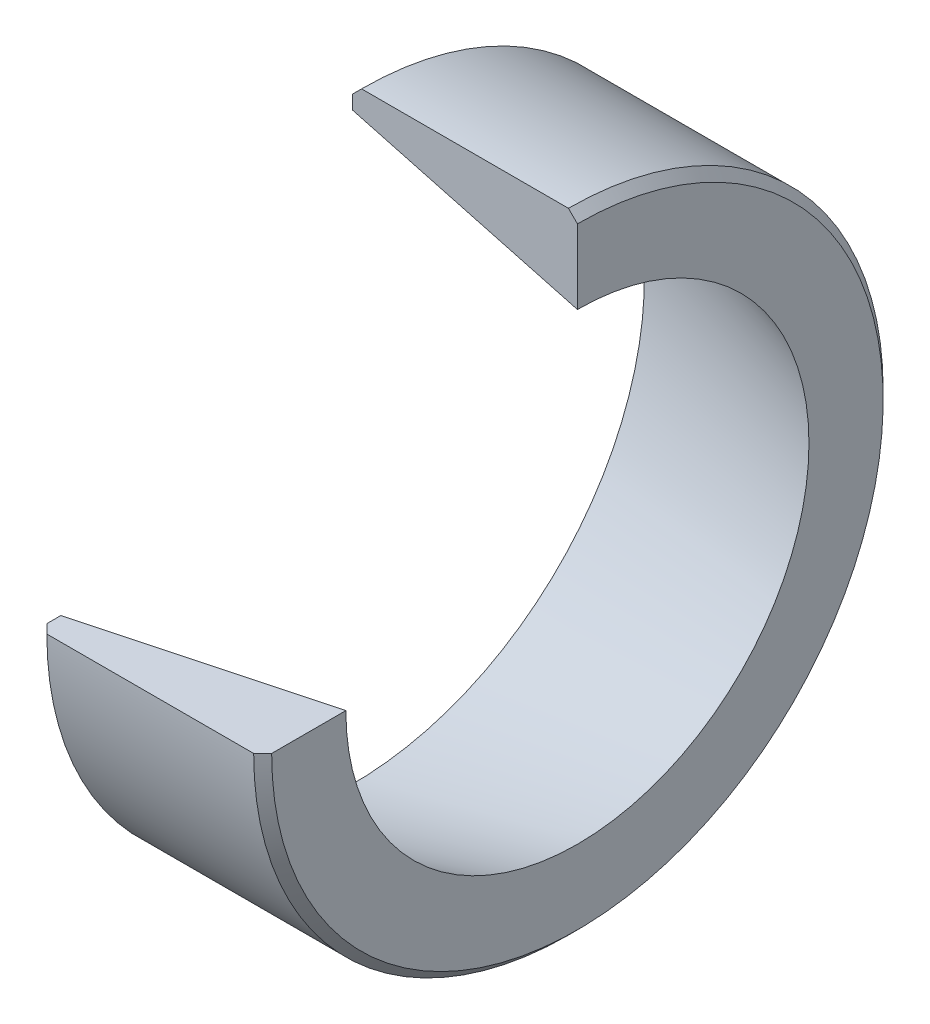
ISO-10303-21;
HEADER;
FILE_DESCRIPTION(('STEP AP214'),'2;1');
FILE_NAME('part.step','',(''),(''),'','','');
FILE_SCHEMA(('AUTOMOTIVE_DESIGN { 1 0 10303 214 1 1 1 1 }'));
ENDSEC;
DATA;
#1=APPLICATION_CONTEXT('core data for automotive mechanical design processes');
#2=APPLICATION_PROTOCOL_DEFINITION('international standard','automotive_design',2000,#1);
#3=PRODUCT_CONTEXT('',#1,'mechanical');
#4=PRODUCT('Part','Part','',(#3));
#5=PRODUCT_RELATED_PRODUCT_CATEGORY('part','',(#4));
#6=PRODUCT_DEFINITION_FORMATION('','',#4);
#7=PRODUCT_DEFINITION_CONTEXT('part definition',#1,'design');
#8=PRODUCT_DEFINITION('design','',#6,#7);
#9=PRODUCT_DEFINITION_SHAPE('','',#8);
#10=(LENGTH_UNIT() NAMED_UNIT(*) SI_UNIT(.MILLI.,.METRE.));
#11=(NAMED_UNIT(*) PLANE_ANGLE_UNIT() SI_UNIT($,.RADIAN.));
#12=(NAMED_UNIT(*) SI_UNIT($,.STERADIAN.) SOLID_ANGLE_UNIT());
#13=UNCERTAINTY_MEASURE_WITH_UNIT(LENGTH_MEASURE(1.E-05),#10,'distance_accuracy_value','');
#14=(GEOMETRIC_REPRESENTATION_CONTEXT(3) GLOBAL_UNCERTAINTY_ASSIGNED_CONTEXT((#13)) GLOBAL_UNIT_ASSIGNED_CONTEXT((#10,
#11,#12)) REPRESENTATION_CONTEXT('',''));
#15=CARTESIAN_POINT('',(0.,0.,0.));
#16=DIRECTION('',(0.,0.,1.));
#17=DIRECTION('',(1.,0.,0.));
#18=AXIS2_PLACEMENT_3D('',#15,#16,#17);
#19=CARTESIAN_POINT('',(-7.04369747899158,0.,0.));
#20=DIRECTION('',(-1.,0.,0.));
#21=DIRECTION('',(0.,0.,1.));
#22=AXIS2_PLACEMENT_3D('',#19,#20,#21);
#23=CYLINDRICAL_SURFACE('',#22,7.);
#24=DIRECTION('',(1.,0.,0.));
#25=VECTOR('',#24,1.);
#26=CARTESIAN_POINT('',(-0.00100000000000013,0.,7.));
#27=LINE('',#26,#25);
#28=CARTESIAN_POINT('',(0.2,0.,7.));
#29=VERTEX_POINT('',#28);
#30=CARTESIAN_POINT('',(4.8,0.,7.));
#31=VERTEX_POINT('',#30);
#32=EDGE_CURVE('E112',#29,#31,#27,.T.);
#33=ORIENTED_EDGE('',*,*,#32,.F.);
#34=CARTESIAN_POINT('',(0.2,0.,0.));
#35=DIRECTION('',(1.,0.,0.));
#36=DIRECTION('',(0.,0.,-1.));
#37=AXIS2_PLACEMENT_3D('',#34,#35,#36);
#38=CIRCLE('',#37,7.);
#39=CARTESIAN_POINT('',(0.199999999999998,7.,0.));
#40=VERTEX_POINT('',#39);
#41=EDGE_CURVE('E124',#29,#40,#38,.T.);
#42=ORIENTED_EDGE('',*,*,#41,.T.);
#43=DIRECTION('',(1.,0.,0.));
#44=VECTOR('',#43,1.);
#45=CARTESIAN_POINT('',(-0.00100000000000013,7.,0.));
#46=LINE('',#45,#44);
#47=CARTESIAN_POINT('',(4.8,7.,0.));
#48=VERTEX_POINT('',#47);
#49=EDGE_CURVE('E129',#40,#48,#46,.T.);
#50=ORIENTED_EDGE('',*,*,#49,.T.);
#51=CARTESIAN_POINT('',(4.8,0.,0.));
#52=DIRECTION('',(-1.,0.,0.));
#53=DIRECTION('',(0.,0.,1.));
#54=AXIS2_PLACEMENT_3D('',#51,#52,#53);
#55=CIRCLE('',#54,7.);
#56=EDGE_CURVE('E121',#48,#31,#55,.T.);
#57=ORIENTED_EDGE('',*,*,#56,.T.);
#58=EDGE_LOOP('',(#33,#42,#50,#57));
#59=FACE_BOUND('',#58,.T.);
#60=ADVANCED_FACE('F33',(#59),#23,.T.);
#61=CARTESIAN_POINT('',(0.,7.,0.));
#62=DIRECTION('',(1.,0.,0.));
#63=DIRECTION('',(0.,0.,-1.));
#64=AXIS2_PLACEMENT_3D('',#61,#62,#63);
#65=PLANE('',#64);
#66=DIRECTION('',(0.,-1.,0.));
#67=VECTOR('',#66,1.);
#68=CARTESIAN_POINT('',(0.,0.,0.));
#69=LINE('',#68,#67);
#70=CARTESIAN_POINT('',(0.,6.8,0.));
#71=VERTEX_POINT('',#70);
#72=CARTESIAN_POINT('',(0.,6.48974596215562,0.));
#73=VERTEX_POINT('',#72);
#74=EDGE_CURVE('E108',#71,#73,#69,.T.);
#75=ORIENTED_EDGE('',*,*,#74,.F.);
#76=CARTESIAN_POINT('',(0.,0.,0.));
#77=DIRECTION('',(1.,0.,0.));
#78=DIRECTION('',(0.,0.,-1.));
#79=AXIS2_PLACEMENT_3D('',#76,#77,#78);
#80=CIRCLE('',#79,6.8);
#81=CARTESIAN_POINT('',(0.,0.,6.8));
#82=VERTEX_POINT('',#81);
#83=EDGE_CURVE('E110',#71,#82,#80,.F.);
#84=ORIENTED_EDGE('',*,*,#83,.T.);
#85=DIRECTION('',(0.,0.,1.));
#86=VECTOR('',#85,1.);
#87=CARTESIAN_POINT('',(0.,0.,0.));
#88=LINE('',#87,#86);
#89=CARTESIAN_POINT('',(0.,0.,6.48974596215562));
#90=VERTEX_POINT('',#89);
#91=EDGE_CURVE('E95',#90,#82,#88,.T.);
#92=ORIENTED_EDGE('',*,*,#91,.F.);
#93=CARTESIAN_POINT('',(0.,0.,0.));
#94=DIRECTION('',(-1.,0.,0.));
#95=DIRECTION('',(0.,0.,1.));
#96=AXIS2_PLACEMENT_3D('',#93,#94,#95);
#97=CIRCLE('',#96,6.48974596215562);
#98=EDGE_CURVE('E104',#73,#90,#97,.T.);
#99=ORIENTED_EDGE('',*,*,#98,.F.);
#100=EDGE_LOOP('',(#75,#84,#92,#99));
#101=FACE_BOUND('',#100,.T.);
#102=ADVANCED_FACE('F134',(#101),#65,.F.);
#103=CARTESIAN_POINT('',(0.,0.,0.));
#104=DIRECTION('',(-1.,0.,0.));
#105=DIRECTION('',(0.,0.,1.));
#106=AXIS2_PLACEMENT_3D('',#103,#104,#105);
#107=CONICAL_SURFACE('',#106,6.48974596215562,0.26179938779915);
#108=ORIENTED_EDGE('',*,*,#98,.T.);
#109=DIRECTION('',(-0.965925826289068,0.,0.258819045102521));
#110=VECTOR('',#109,1.);
#111=CARTESIAN_POINT('',(24.2200616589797,0.,0.));
#112=LINE('',#111,#110);
#113=CARTESIAN_POINT('',(5.,0.,5.15));
#114=VERTEX_POINT('',#113);
#115=EDGE_CURVE('E89',#114,#90,#112,.T.);
#116=ORIENTED_EDGE('',*,*,#115,.F.);
#117=CARTESIAN_POINT('',(5.,0.,0.));
#118=DIRECTION('',(-1.,0.,0.));
#119=DIRECTION('',(0.,0.,1.));
#120=AXIS2_PLACEMENT_3D('',#117,#118,#119);
#121=CIRCLE('',#120,5.15);
#122=CARTESIAN_POINT('',(5.,5.15,0.));
#123=VERTEX_POINT('',#122);
#124=EDGE_CURVE('E102',#123,#114,#121,.T.);
#125=ORIENTED_EDGE('',*,*,#124,.F.);
#126=DIRECTION('',(0.965925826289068,-0.258819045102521,0.));
#127=VECTOR('',#126,1.);
#128=CARTESIAN_POINT('',(24.2200616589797,0.,0.));
#129=LINE('',#128,#127);
#130=EDGE_CURVE('E105',#73,#123,#129,.T.);
#131=ORIENTED_EDGE('',*,*,#130,.F.);
#132=EDGE_LOOP('',(#108,#116,#125,#131));
#133=FACE_BOUND('',#132,.T.);
#134=ADVANCED_FACE('F100',(#133),#107,.F.);
#135=CARTESIAN_POINT('',(5.,5.15,0.));
#136=DIRECTION('',(-1.,0.,0.));
#137=DIRECTION('',(0.,0.,1.));
#138=AXIS2_PLACEMENT_3D('',#135,#136,#137);
#139=PLANE('',#138);
#140=DIRECTION('',(0.,0.,-1.));
#141=VECTOR('',#140,1.);
#142=CARTESIAN_POINT('',(5.,0.,0.));
#143=LINE('',#142,#141);
#144=CARTESIAN_POINT('',(5.,0.,6.8));
#145=VERTEX_POINT('',#144);
#146=EDGE_CURVE('E85',#145,#114,#143,.T.);
#147=ORIENTED_EDGE('',*,*,#146,.F.);
#148=CARTESIAN_POINT('',(5.,0.,0.));
#149=DIRECTION('',(-1.,0.,0.));
#150=DIRECTION('',(0.,0.,1.));
#151=AXIS2_PLACEMENT_3D('',#148,#149,#150);
#152=CIRCLE('',#151,6.8);
#153=CARTESIAN_POINT('',(5.,6.8,0.));
#154=VERTEX_POINT('',#153);
#155=EDGE_CURVE('E11',#145,#154,#152,.F.);
#156=ORIENTED_EDGE('',*,*,#155,.T.);
#157=DIRECTION('',(0.,1.,0.));
#158=VECTOR('',#157,1.);
#159=CARTESIAN_POINT('',(5.,0.,0.));
#160=LINE('',#159,#158);
#161=EDGE_CURVE('E94',#123,#154,#160,.T.);
#162=ORIENTED_EDGE('',*,*,#161,.F.);
#163=ORIENTED_EDGE('',*,*,#124,.T.);
#164=EDGE_LOOP('',(#147,#156,#162,#163));
#165=FACE_BOUND('',#164,.T.);
#166=ADVANCED_FACE('F107',(#165),#139,.F.);
#167=CARTESIAN_POINT('',(-0.00100000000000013,0.,0.));
#168=DIRECTION('',(0.,0.,-1.));
#169=DIRECTION('',(-1.,0.,0.));
#170=AXIS2_PLACEMENT_3D('',#167,#168,#169);
#171=PLANE('',#170);
#172=ORIENTED_EDGE('',*,*,#49,.F.);
#173=DIRECTION('',(0.707106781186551,0.707106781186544,0.));
#174=VECTOR('',#173,1.);
#175=CARTESIAN_POINT('',(-6.80000000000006,0.,0.));
#176=LINE('',#175,#174);
#177=EDGE_CURVE('E41',#40,#71,#176,.F.);
#178=ORIENTED_EDGE('',*,*,#177,.T.);
#179=ORIENTED_EDGE('',*,*,#74,.T.);
#180=ORIENTED_EDGE('',*,*,#130,.T.);
#181=ORIENTED_EDGE('',*,*,#161,.T.);
#182=DIRECTION('',(0.707106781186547,-0.707106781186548,0.));
#183=VECTOR('',#182,1.);
#184=CARTESIAN_POINT('',(11.8,0.,0.));
#185=LINE('',#184,#183);
#186=EDGE_CURVE('E53',#154,#48,#185,.F.);
#187=ORIENTED_EDGE('',*,*,#186,.T.);
#188=EDGE_LOOP('',(#172,#178,#179,#180,#181,#187));
#189=FACE_BOUND('',#188,.T.);
#190=ADVANCED_FACE('F128',(#189),#171,.F.);
#191=CARTESIAN_POINT('',(-0.00100000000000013,0.,0.));
#192=DIRECTION('',(0.,-1.,0.));
#193=DIRECTION('',(0.,0.,-1.));
#194=AXIS2_PLACEMENT_3D('',#191,#192,#193);
#195=PLANE('',#194);
#196=ORIENTED_EDGE('',*,*,#91,.T.);
#197=DIRECTION('',(-0.707106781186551,0.,-0.707106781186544));
#198=VECTOR('',#197,1.);
#199=CARTESIAN_POINT('',(-6.80000000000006,0.,0.));
#200=LINE('',#199,#198);
#201=EDGE_CURVE('E119',#82,#29,#200,.F.);
#202=ORIENTED_EDGE('',*,*,#201,.T.);
#203=ORIENTED_EDGE('',*,*,#32,.T.);
#204=DIRECTION('',(-0.707106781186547,0.,0.707106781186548));
#205=VECTOR('',#204,1.);
#206=CARTESIAN_POINT('',(11.8,0.,0.));
#207=LINE('',#206,#205);
#208=EDGE_CURVE('E92',#31,#145,#207,.F.);
#209=ORIENTED_EDGE('',*,*,#208,.T.);
#210=ORIENTED_EDGE('',*,*,#146,.T.);
#211=ORIENTED_EDGE('',*,*,#115,.T.);
#212=EDGE_LOOP('',(#196,#202,#203,#209,#210,#211));
#213=FACE_BOUND('',#212,.T.);
#214=ADVANCED_FACE('F88',(#213),#195,.F.);
#215=CARTESIAN_POINT('',(0.,0.,0.));
#216=DIRECTION('',(1.,0.,0.));
#217=DIRECTION('',(0.,0.,-1.));
#218=AXIS2_PLACEMENT_3D('',#215,#216,#217);
#219=CONICAL_SURFACE('',#218,6.8,0.785398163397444);
#220=ORIENTED_EDGE('',*,*,#177,.F.);
#221=ORIENTED_EDGE('',*,*,#41,.F.);
#222=ORIENTED_EDGE('',*,*,#201,.F.);
#223=ORIENTED_EDGE('',*,*,#83,.F.);
#224=EDGE_LOOP('',(#220,#221,#222,#223));
#225=FACE_BOUND('',#224,.T.);
#226=ADVANCED_FACE('F135',(#225),#219,.T.);
#227=CARTESIAN_POINT('',(4.8,0.,0.));
#228=DIRECTION('',(-1.,0.,0.));
#229=DIRECTION('',(0.,0.,1.));
#230=AXIS2_PLACEMENT_3D('',#227,#228,#229);
#231=CONICAL_SURFACE('',#230,7.,0.785398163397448);
#232=ORIENTED_EDGE('',*,*,#186,.F.);
#233=ORIENTED_EDGE('',*,*,#155,.F.);
#234=ORIENTED_EDGE('',*,*,#208,.F.);
#235=ORIENTED_EDGE('',*,*,#56,.F.);
#236=EDGE_LOOP('',(#232,#233,#234,#235));
#237=FACE_BOUND('',#236,.T.);
#238=ADVANCED_FACE('F35',(#237),#231,.T.);
#239=CLOSED_SHELL('',(#60,#102,#134,#166,#190,#214,#226,#238));
#240=MANIFOLD_SOLID_BREP('B2',#239);
#241=ADVANCED_BREP_SHAPE_REPRESENTATION('',(#18,#240),#14);
#242=SHAPE_DEFINITION_REPRESENTATION(#9,#241);
ENDSEC;
END-ISO-10303-21;
